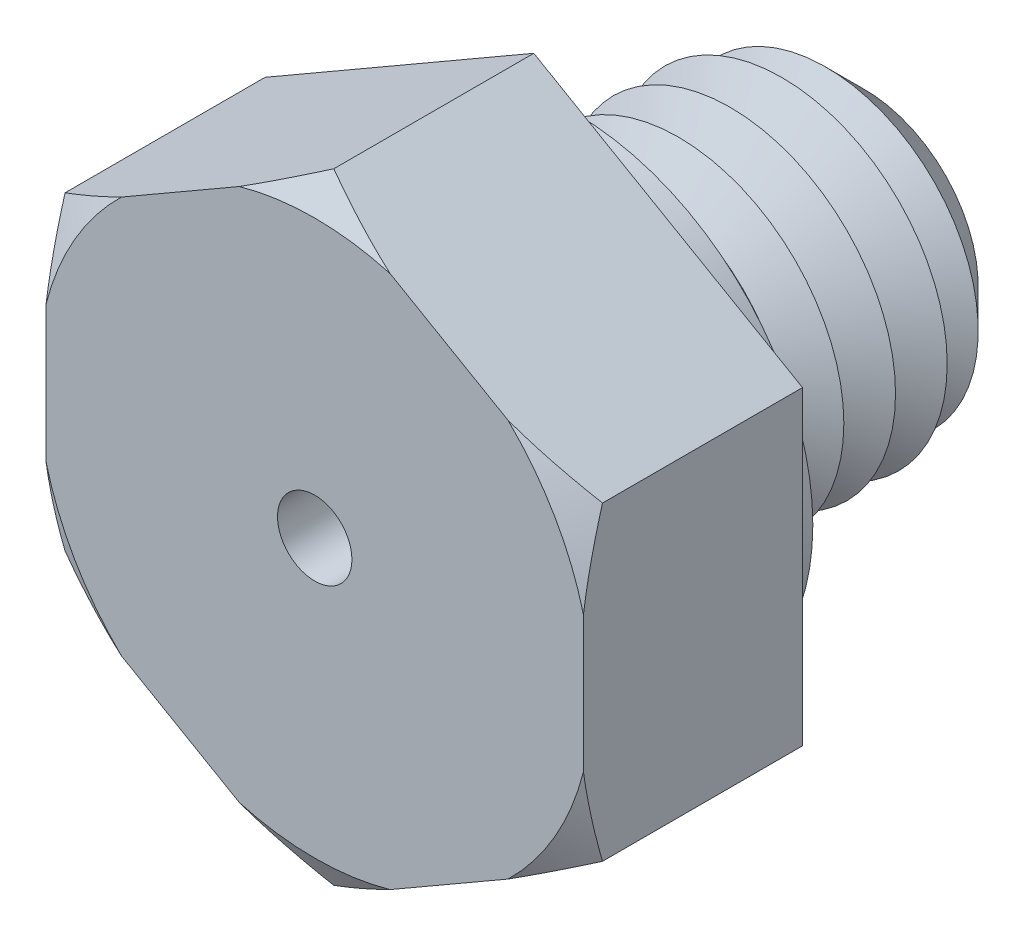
ISO-10303-21;
HEADER;
FILE_DESCRIPTION(('STEP AP214'),'2;1');
FILE_NAME('part.step','',(''),(''),'','','');
FILE_SCHEMA(('AUTOMOTIVE_DESIGN { 1 0 10303 214 1 1 1 1 }'));
ENDSEC;
DATA;
#1=APPLICATION_CONTEXT('core data for automotive mechanical design processes');
#2=APPLICATION_PROTOCOL_DEFINITION('international standard','automotive_design',2000,#1);
#3=PRODUCT_CONTEXT('',#1,'mechanical');
#4=PRODUCT('Part','Part','',(#3));
#5=PRODUCT_RELATED_PRODUCT_CATEGORY('part','',(#4));
#6=PRODUCT_DEFINITION_FORMATION('','',#4);
#7=PRODUCT_DEFINITION_CONTEXT('part definition',#1,'design');
#8=PRODUCT_DEFINITION('design','',#6,#7);
#9=PRODUCT_DEFINITION_SHAPE('','',#8);
#10=(LENGTH_UNIT() NAMED_UNIT(*) SI_UNIT(.MILLI.,.METRE.));
#11=(NAMED_UNIT(*) PLANE_ANGLE_UNIT() SI_UNIT($,.RADIAN.));
#12=(NAMED_UNIT(*) SI_UNIT($,.STERADIAN.) SOLID_ANGLE_UNIT());
#13=UNCERTAINTY_MEASURE_WITH_UNIT(LENGTH_MEASURE(1.E-05),#10,'distance_accuracy_value','');
#14=(GEOMETRIC_REPRESENTATION_CONTEXT(3) GLOBAL_UNCERTAINTY_ASSIGNED_CONTEXT((#13)) GLOBAL_UNIT_ASSIGNED_CONTEXT((#10,
#11,#12)) REPRESENTATION_CONTEXT('',''));
#15=CARTESIAN_POINT('',(0.,0.,0.));
#16=DIRECTION('',(0.,0.,1.));
#17=DIRECTION('',(1.,0.,0.));
#18=AXIS2_PLACEMENT_3D('',#15,#16,#17);
#19=CARTESIAN_POINT('',(6.5,3.75277674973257,5.3));
#20=DIRECTION('',(-0.5,-0.866025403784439,0.));
#21=DIRECTION('',(0.866025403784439,-0.5,0.));
#22=AXIS2_PLACEMENT_3D('',#19,#20,#21);
#23=PLANE('',#22);
#24=CARTESIAN_POINT('',(11.0120510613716,1.14774285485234,2.7792030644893));
#25=CARTESIAN_POINT('',(10.8078344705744,1.26564735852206,2.88939185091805));
#26=CARTESIAN_POINT('',(10.6031290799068,1.3838340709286,2.99839128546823));
#27=CARTESIAN_POINT('',(10.1925345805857,1.62089091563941,3.21345290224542));
#28=CARTESIAN_POINT('',(9.98664532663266,1.73976113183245,3.31951471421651));
#29=CARTESIAN_POINT('',(9.572864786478,1.97865743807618,3.52844955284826));
#30=CARTESIAN_POINT('',(9.36496919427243,2.09868601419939,3.63131124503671));
#31=CARTESIAN_POINT('',(8.94762012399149,2.33964261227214,3.8327211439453));
#32=CARTESIAN_POINT('',(8.73816669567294,2.46057060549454,3.93126948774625));
#33=CARTESIAN_POINT('',(8.31210847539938,2.70655543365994,4.12554493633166));
#34=CARTESIAN_POINT('',(8.0954571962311,2.83163910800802,4.22113674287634));
#35=CARTESIAN_POINT('',(7.65996896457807,3.08306835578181,4.40550790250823));
#36=CARTESIAN_POINT('',(7.44113190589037,3.20941399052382,4.49428692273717));
#37=CARTESIAN_POINT('',(7.00122142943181,3.46339642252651,4.66334180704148));
#38=CARTESIAN_POINT('',(6.78015039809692,3.59103184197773,4.74362587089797));
#39=CARTESIAN_POINT('',(6.33541282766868,3.84780119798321,4.89383693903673));
#40=CARTESIAN_POINT('',(6.11174662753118,3.97693493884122,4.96376527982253));
#41=CARTESIAN_POINT('',(5.57683009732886,4.28576914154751,5.11501441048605));
#42=CARTESIAN_POINT('',(5.26433342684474,4.46618917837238,5.19069976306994));
#43=CARTESIAN_POINT('',(4.79238520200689,4.73866861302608,5.28165255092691));
#44=CARTESIAN_POINT('',(4.63453792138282,4.82980178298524,5.30820735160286));
#45=CARTESIAN_POINT('',(4.31797843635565,5.01256748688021,5.35312391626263));
#46=CARTESIAN_POINT('',(4.15926635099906,5.10419995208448,5.37148678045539));
#47=CARTESIAN_POINT('',(3.84309853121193,5.28673952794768,5.3993333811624));
#48=CARTESIAN_POINT('',(3.68564943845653,5.37764280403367,5.4089171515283));
#49=CARTESIAN_POINT('',(3.37053331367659,5.55957518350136,5.41928234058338));
#50=CARTESIAN_POINT('',(3.21286628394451,5.6506042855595,5.42006385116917));
#51=CARTESIAN_POINT('',(2.89768626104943,5.83257355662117,5.41279964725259));
#52=CARTESIAN_POINT('',(2.74017326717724,5.92351372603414,5.40475397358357));
#53=CARTESIAN_POINT('',(2.42563627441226,6.1051117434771,5.38007889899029));
#54=CARTESIAN_POINT('',(2.26861235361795,6.1957695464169,5.36344819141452));
#55=CARTESIAN_POINT('',(1.89764555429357,6.40994732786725,5.31443879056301));
#56=CARTESIAN_POINT('',(1.68405122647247,6.53326607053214,5.27851525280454));
#57=CARTESIAN_POINT('',(1.258907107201,6.77872314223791,5.19313397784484));
#58=CARTESIAN_POINT('',(1.04735761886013,6.90086129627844,5.14367426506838));
#59=CARTESIAN_POINT('',(0.626329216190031,7.1439421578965,5.03308780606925));
#60=CARTESIAN_POINT('',(0.416852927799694,7.2648833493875,4.9719478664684));
#61=CARTESIAN_POINT('',(0.000251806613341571,7.50540811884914,4.83992704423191));
#62=CARTESIAN_POINT('',(-0.206873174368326,7.6249917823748,4.76904677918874));
#63=CARTESIAN_POINT('',(-0.621367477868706,7.86430018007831,4.61833709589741));
#64=CARTESIAN_POINT('',(-0.828710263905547,7.98400959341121,4.53841104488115));
#65=CARTESIAN_POINT('',(-1.24119921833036,8.22216020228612,4.37184860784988));
#66=CARTESIAN_POINT('',(-1.44634674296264,8.34060218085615,4.28521667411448));
#67=CARTESIAN_POINT('',(-1.8547720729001,8.57640665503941,4.10643213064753));
#68=CARTESIAN_POINT('',(-2.05805026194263,8.69376937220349,4.01428068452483));
#69=CARTESIAN_POINT('',(-2.46301289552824,8.92757465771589,3.82542322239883));
#70=CARTESIAN_POINT('',(-2.66469731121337,9.04401720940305,3.72871712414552));
#71=CARTESIAN_POINT('',(-3.00477721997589,9.24036243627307,3.56190249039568));
#72=CARTESIAN_POINT('',(-3.14353507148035,9.32047431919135,3.49277477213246));
#73=CARTESIAN_POINT('',(-3.42044427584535,9.48034792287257,3.35293264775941));
#74=CARTESIAN_POINT('',(-3.55859564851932,9.5601096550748,3.28221829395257));
#75=CARTESIAN_POINT('',(-3.83290330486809,9.71848125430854,3.14014092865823));
#76=CARTESIAN_POINT('',(-3.96906528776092,9.7970944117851,3.06879256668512));
#77=CARTESIAN_POINT('',(-4.24090766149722,9.9540426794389,2.92487520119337));
#78=CARTESIAN_POINT('',(-4.37658804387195,10.0323777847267,2.85230617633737));
#79=CARTESIAN_POINT('',(-4.5120510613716,10.1105873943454,2.7792030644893));
#80=B_SPLINE_CURVE_WITH_KNOTS('',3,(#24,#25,#26,#27,#28,#29,#30,#31,#32,#33,#34,#35,#36,#37,#38,
#39,#40,#41,#42,#43,#44,#45,#46,#47,#48,#49,#50,#51,#52,#53,#54,#55,#56,#57,#58,#59,#60,#61,#62,
#63,#64,#65,#66,#67,#68,#69,#70,#71,#72,#73,#74,#75,#76,#77,#78,#79),.UNSPECIFIED.,.F.,.F.,(4,2,
2,2,2,2,2,2,2,2,2,2,2,2,2,2,2,2,2,2,2,2,2,2,2,2,2,4),(0.,0.780858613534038,1.56181520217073,
2.34527979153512,3.12871946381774,3.93206444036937,4.73544864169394,5.53805016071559,
6.3405480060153,7.44542333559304,7.99784254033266,8.55018753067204,9.09615753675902,
9.64212184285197,10.1880836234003,10.7341285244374,11.4813961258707,12.2287728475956,
12.9769988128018,13.7251773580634,14.4822772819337,15.2388787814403,15.9953213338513,
16.7517775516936,17.2752695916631,17.7987444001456,18.3167123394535,18.8346893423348),.UNSPECIFIED.);
#81=CARTESIAN_POINT('',(6.5,3.75277674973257,4.83811978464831));
#82=VERTEX_POINT('',#81);
#83=CARTESIAN_POINT('',(4.67682717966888,4.80538606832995,5.3));
#84=VERTEX_POINT('',#83);
#85=EDGE_CURVE('E132',#82,#84,#80,.T.);
#86=ORIENTED_EDGE('',*,*,#85,.F.);
#87=DIRECTION('',(0.,0.,-1.));
#88=VECTOR('',#87,1.);
#89=CARTESIAN_POINT('',(6.5,3.75277674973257,5.3));
#90=LINE('',#89,#88);
#91=CARTESIAN_POINT('',(6.5,3.75277674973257,0.));
#92=VERTEX_POINT('',#91);
#93=EDGE_CURVE('E144',#82,#92,#90,.T.);
#94=ORIENTED_EDGE('',*,*,#93,.T.);
#95=DIRECTION('',(-0.866025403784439,0.5,0.));
#96=VECTOR('',#95,1.);
#97=CARTESIAN_POINT('',(6.5,3.75277674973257,0.));
#98=LINE('',#97,#96);
#99=CARTESIAN_POINT('',(0.,7.50555349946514,0.));
#100=VERTEX_POINT('',#99);
#101=EDGE_CURVE('E242',#92,#100,#98,.T.);
#102=ORIENTED_EDGE('',*,*,#101,.T.);
#103=DIRECTION('',(0.,0.,-1.));
#104=VECTOR('',#103,1.);
#105=CARTESIAN_POINT('',(0.,7.50555349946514,5.3));
#106=LINE('',#105,#104);
#107=CARTESIAN_POINT('',(0.,7.50555349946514,4.83811978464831));
#108=VERTEX_POINT('',#107);
#109=EDGE_CURVE('E178',#108,#100,#106,.T.);
#110=ORIENTED_EDGE('',*,*,#109,.F.);
#111=CARTESIAN_POINT('',(1.82317282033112,6.45294418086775,5.3));
#112=VERTEX_POINT('',#111);
#113=EDGE_CURVE('E151',#112,#108,#80,.T.);
#114=ORIENTED_EDGE('',*,*,#113,.F.);
#115=DIRECTION('',(-0.866025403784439,0.5,0.));
#116=VECTOR('',#115,1.);
#117=CARTESIAN_POINT('',(6.5,3.75277674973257,5.3));
#118=LINE('',#117,#116);
#119=EDGE_CURVE('E148',#84,#112,#118,.T.);
#120=ORIENTED_EDGE('',*,*,#119,.F.);
#121=EDGE_LOOP('',(#86,#94,#102,#110,#114,#120));
#122=FACE_BOUND('',#121,.T.);
#123=ADVANCED_FACE('F39',(#122),#23,.F.);
#124=CARTESIAN_POINT('',(0.,7.50555349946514,5.3));
#125=DIRECTION('',(0.5,-0.866025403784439,0.));
#126=DIRECTION('',(0.866025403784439,0.5,0.));
#127=AXIS2_PLACEMENT_3D('',#124,#125,#126);
#128=PLANE('',#127);
#129=CARTESIAN_POINT('',(4.51205106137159,10.1105873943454,2.77920306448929));
#130=CARTESIAN_POINT('',(4.30783447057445,9.99268289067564,2.88939185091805));
#131=CARTESIAN_POINT('',(4.1031290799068,9.87449617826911,2.99839128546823));
#132=CARTESIAN_POINT('',(3.69253458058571,9.63743933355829,3.21345290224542));
#133=CARTESIAN_POINT('',(3.48664532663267,9.51856911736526,3.31951471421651));
#134=CARTESIAN_POINT('',(3.072864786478,9.27967281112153,3.52844955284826));
#135=CARTESIAN_POINT('',(2.86496919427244,9.15964423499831,3.63131124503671));
#136=CARTESIAN_POINT('',(2.44762012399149,8.91868763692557,3.8327211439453));
#137=CARTESIAN_POINT('',(2.23816669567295,8.79775964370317,3.93126948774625));
#138=CARTESIAN_POINT('',(1.81210847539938,8.55177481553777,4.12554493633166));
#139=CARTESIAN_POINT('',(1.5954571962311,8.42669114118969,4.22113674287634));
#140=CARTESIAN_POINT('',(1.15996896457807,8.1752618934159,4.40550790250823));
#141=CARTESIAN_POINT('',(0.941131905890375,8.04891625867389,4.49428692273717));
#142=CARTESIAN_POINT('',(0.501221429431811,7.7949338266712,4.66334180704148));
#143=CARTESIAN_POINT('',(0.280150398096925,7.66729840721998,4.74362587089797));
#144=CARTESIAN_POINT('',(-0.164587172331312,7.41052905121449,4.89383693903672));
#145=CARTESIAN_POINT('',(-0.388253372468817,7.28139531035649,4.96376527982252));
#146=CARTESIAN_POINT('',(-0.923169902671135,6.9725611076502,5.11501441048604));
#147=CARTESIAN_POINT('',(-1.23566657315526,6.79214107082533,5.19069976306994));
#148=CARTESIAN_POINT('',(-1.7076147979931,6.51966163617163,5.28165255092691));
#149=CARTESIAN_POINT('',(-1.86546207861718,6.42852846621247,5.30820735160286));
#150=CARTESIAN_POINT('',(-2.18202156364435,6.2457627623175,5.35312391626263));
#151=CARTESIAN_POINT('',(-2.34073364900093,6.15413029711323,5.37148678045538));
#152=CARTESIAN_POINT('',(-2.65690146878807,5.97159072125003,5.3993333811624));
#153=CARTESIAN_POINT('',(-2.81435056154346,5.88068744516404,5.40891715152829));
#154=CARTESIAN_POINT('',(-3.12946668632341,5.69875506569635,5.41928234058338));
#155=CARTESIAN_POINT('',(-3.28713371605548,5.60772596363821,5.42006385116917));
#156=CARTESIAN_POINT('',(-3.60231373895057,5.42575669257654,5.41279964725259));
#157=CARTESIAN_POINT('',(-3.75982673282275,5.33481652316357,5.40475397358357));
#158=CARTESIAN_POINT('',(-4.07436372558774,5.15321850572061,5.38007889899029));
#159=CARTESIAN_POINT('',(-4.23138764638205,5.06256070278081,5.36344819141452));
#160=CARTESIAN_POINT('',(-4.60235444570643,4.84838292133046,5.31443879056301));
#161=CARTESIAN_POINT('',(-4.81594877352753,4.72506417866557,5.27851525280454));
#162=CARTESIAN_POINT('',(-5.24109289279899,4.4796071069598,5.19313397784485));
#163=CARTESIAN_POINT('',(-5.45264238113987,4.35746895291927,5.14367426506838));
#164=CARTESIAN_POINT('',(-5.87367078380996,4.11438809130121,5.03308780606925));
#165=CARTESIAN_POINT('',(-6.0831470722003,3.99344689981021,4.9719478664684));
#166=CARTESIAN_POINT('',(-6.49974819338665,3.75292213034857,4.83992704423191));
#167=CARTESIAN_POINT('',(-6.70687317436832,3.63333846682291,4.76904677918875));
#168=CARTESIAN_POINT('',(-7.1213674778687,3.3940300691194,4.61833709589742));
#169=CARTESIAN_POINT('',(-7.32871026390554,3.2743206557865,4.53841104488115));
#170=CARTESIAN_POINT('',(-7.74119921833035,3.03617004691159,4.37184860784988));
#171=CARTESIAN_POINT('',(-7.94634674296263,2.91772806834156,4.28521667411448));
#172=CARTESIAN_POINT('',(-8.35477207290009,2.6819235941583,4.10643213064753));
#173=CARTESIAN_POINT('',(-8.55805026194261,2.56456087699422,4.01428068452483));
#174=CARTESIAN_POINT('',(-8.96301289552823,2.33075559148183,3.82542322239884));
#175=CARTESIAN_POINT('',(-9.16469731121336,2.21431303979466,3.72871712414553));
#176=CARTESIAN_POINT('',(-9.50477721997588,2.01796781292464,3.56190249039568));
#177=CARTESIAN_POINT('',(-9.64353507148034,1.93785593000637,3.49277477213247));
#178=CARTESIAN_POINT('',(-9.92044427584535,1.77798232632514,3.35293264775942));
#179=CARTESIAN_POINT('',(-10.0585956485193,1.69822059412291,3.28221829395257));
#180=CARTESIAN_POINT('',(-10.3329033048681,1.53984899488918,3.14014092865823));
#181=CARTESIAN_POINT('',(-10.4690652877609,1.46123583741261,3.06879256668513));
#182=CARTESIAN_POINT('',(-10.7409076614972,1.30428756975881,2.92487520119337));
#183=CARTESIAN_POINT('',(-10.876588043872,1.225952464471,2.85230617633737));
#184=CARTESIAN_POINT('',(-11.0120510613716,1.14774285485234,2.7792030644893));
#185=B_SPLINE_CURVE_WITH_KNOTS('',3,(#129,#130,#131,#132,#133,#134,#135,#136,#137,#138,#139,
#140,#141,#142,#143,#144,#145,#146,#147,#148,#149,#150,#151,#152,#153,#154,#155,#156,#157,#158,
#159,#160,#161,#162,#163,#164,#165,#166,#167,#168,#169,#170,#171,#172,#173,#174,#175,#176,#177,
#178,#179,#180,#181,#182,#183,#184),.UNSPECIFIED.,.F.,.F.,(4,2,2,2,2,2,2,2,2,2,2,2,2,2,2,2,2,2,
2,2,2,2,2,2,2,2,2,4),(0.,0.780858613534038,1.56181520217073,2.34527979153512,3.12871946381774,
3.93206444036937,4.73544864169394,5.53805016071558,6.3405480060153,7.44542333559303,
7.99784254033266,8.55018753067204,9.09615753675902,9.64212184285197,10.1880836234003,
10.7341285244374,11.4813961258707,12.2287728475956,12.9769988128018,13.7251773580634,
14.4822772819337,15.2388787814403,15.9953213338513,16.7517775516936,17.2752695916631,
17.7987444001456,18.3167123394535,18.8346893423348),.UNSPECIFIED.);
#186=CARTESIAN_POINT('',(-1.82317282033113,6.45294418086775,5.3));
#187=VERTEX_POINT('',#186);
#188=EDGE_CURVE('E282',#108,#187,#185,.T.);
#189=ORIENTED_EDGE('',*,*,#188,.F.);
#190=ORIENTED_EDGE('',*,*,#109,.T.);
#191=DIRECTION('',(-0.866025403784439,-0.5,0.));
#192=VECTOR('',#191,1.);
#193=CARTESIAN_POINT('',(0.,7.50555349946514,0.));
#194=LINE('',#193,#192);
#195=CARTESIAN_POINT('',(-6.5,3.75277674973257,0.));
#196=VERTEX_POINT('',#195);
#197=EDGE_CURVE('E261',#100,#196,#194,.T.);
#198=ORIENTED_EDGE('',*,*,#197,.T.);
#199=DIRECTION('',(0.,0.,-1.));
#200=VECTOR('',#199,1.);
#201=CARTESIAN_POINT('',(-6.5,3.75277674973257,5.3));
#202=LINE('',#201,#200);
#203=CARTESIAN_POINT('',(-6.5,3.75277674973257,4.83811978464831));
#204=VERTEX_POINT('',#203);
#205=EDGE_CURVE('E175',#204,#196,#202,.T.);
#206=ORIENTED_EDGE('',*,*,#205,.F.);
#207=CARTESIAN_POINT('',(-4.67682717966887,4.80538606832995,5.3));
#208=VERTEX_POINT('',#207);
#209=EDGE_CURVE('E283',#208,#204,#185,.T.);
#210=ORIENTED_EDGE('',*,*,#209,.F.);
#211=DIRECTION('',(-0.866025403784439,-0.5,0.));
#212=VECTOR('',#211,1.);
#213=CARTESIAN_POINT('',(0.,7.50555349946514,5.3));
#214=LINE('',#213,#212);
#215=EDGE_CURVE('E245',#187,#208,#214,.T.);
#216=ORIENTED_EDGE('',*,*,#215,.F.);
#217=EDGE_LOOP('',(#189,#190,#198,#206,#210,#216));
#218=FACE_BOUND('',#217,.T.);
#219=ADVANCED_FACE('F301',(#218),#128,.F.);
#220=CARTESIAN_POINT('',(-6.5,3.75277674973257,5.3));
#221=DIRECTION('',(1.,0.,0.));
#222=DIRECTION('',(0.,0.,-1.));
#223=AXIS2_PLACEMENT_3D('',#220,#221,#222);
#224=PLANE('',#223);
#225=CARTESIAN_POINT('',(-6.5,8.26482781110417,3.10083044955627));
#226=CARTESIAN_POINT('',(-6.5,8.03000458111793,3.20736842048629));
#227=CARTESIAN_POINT('',(-6.5,7.79453887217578,3.31251727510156));
#228=CARTESIAN_POINT('',(-6.5,7.32204728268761,3.51936269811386));
#229=CARTESIAN_POINT('',(-6.5,7.08502112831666,3.62105864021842));
#230=CARTESIAN_POINT('',(-6.5,6.6082238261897,3.82070151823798));
#231=CARTESIAN_POINT('',(-6.5,6.36844534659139,3.91863101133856));
#232=CARTESIAN_POINT('',(-6.5,5.88686103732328,4.10935828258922));
#233=CARTESIAN_POINT('',(-6.5,5.64505530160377,4.20215629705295));
#234=CARTESIAN_POINT('',(-6.5,5.16020806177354,4.38107583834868));
#235=CARTESIAN_POINT('',(-6.5,4.91717698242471,4.46722547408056));
#236=CARTESIAN_POINT('',(-6.5,4.42851680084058,4.63190822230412));
#237=CARTESIAN_POINT('',(-6.5,4.18288757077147,4.71044095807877));
#238=CARTESIAN_POINT('',(-6.5,3.68915983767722,4.85808723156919));
#239=CARTESIAN_POINT('',(-6.5,3.44106517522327,4.9272135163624));
#240=CARTESIAN_POINT('',(-6.5,2.94198131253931,5.05420795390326));
#241=CARTESIAN_POINT('',(-6.5,2.69099223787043,5.11207659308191));
#242=CARTESIAN_POINT('',(-6.5,2.25769005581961,5.19995201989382));
#243=CARTESIAN_POINT('',(-6.5,2.07603591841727,5.23320954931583));
#244=CARTESIAN_POINT('',(-6.5,1.71151122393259,5.29207741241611));
#245=CARTESIAN_POINT('',(-6.5,1.52864087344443,5.31768901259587));
#246=CARTESIAN_POINT('',(-6.5,1.16195360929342,5.36059506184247));
#247=CARTESIAN_POINT('',(-6.5,0.978136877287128,5.37789105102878));
#248=CARTESIAN_POINT('',(-6.5,0.609880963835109,5.40367049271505));
#249=CARTESIAN_POINT('',(-6.5,0.425441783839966,5.41215396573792));
#250=CARTESIAN_POINT('',(-6.5,0.056461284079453,5.42004368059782));
#251=CARTESIAN_POINT('',(-6.5,-0.128079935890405,5.41945454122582));
#252=CARTESIAN_POINT('',(-6.5,-0.496907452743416,5.40922941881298));
#253=CARTESIAN_POINT('',(-6.5,-0.681193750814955,5.39959347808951));
#254=CARTESIAN_POINT('',(-6.5,-1.04910266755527,5.37156866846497));
#255=CARTESIAN_POINT('',(-6.5,-1.23272526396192,5.35317950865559));
#256=CARTESIAN_POINT('',(-6.5,-1.5989735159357,5.30817918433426));
#257=CARTESIAN_POINT('',(-6.5,-1.78159898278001,5.28156651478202));
#258=CARTESIAN_POINT('',(-6.5,-2.50904762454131,5.16009602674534));
#259=CARTESIAN_POINT('',(-6.5,-3.04897729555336,5.0350728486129));
#260=CARTESIAN_POINT('',(-6.5,-3.8489021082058,4.8122065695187));
#261=CARTESIAN_POINT('',(-6.5,-4.11422810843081,4.73189887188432));
#262=CARTESIAN_POINT('',(-6.5,-4.64182213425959,4.5617271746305));
#263=CARTESIAN_POINT('',(-6.5,-4.90409037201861,4.47186384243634));
#264=CARTESIAN_POINT('',(-6.5,-5.42881258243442,4.28339622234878));
#265=CARTESIAN_POINT('',(-6.5,-5.69123450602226,4.18470387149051));
#266=CARTESIAN_POINT('',(-6.5,-6.21363007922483,3.98100889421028));
#267=CARTESIAN_POINT('',(-6.5,-6.4736035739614,3.87600587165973));
#268=CARTESIAN_POINT('',(-6.5,-6.98982707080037,3.66159357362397));
#269=CARTESIAN_POINT('',(-6.5,-7.24609016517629,3.55221565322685));
#270=CARTESIAN_POINT('',(-6.5,-7.75676014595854,3.32937132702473));
#271=CARTESIAN_POINT('',(-6.5,-8.01116747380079,3.2159059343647));
#272=CARTESIAN_POINT('',(-6.5,-8.26482781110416,3.10083044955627));
#273=B_SPLINE_CURVE_WITH_KNOTS('',3,(#225,#226,#227,#228,#229,#230,#231,#232,#233,#234,#235,
#236,#237,#238,#239,#240,#241,#242,#243,#244,#245,#246,#247,#248,#249,#250,#251,#252,#253,#254,
#255,#256,#257,#258,#259,#260,#261,#262,#263,#264,#265,#266,#267,#268,#269,#270,#271,#272),
.UNSPECIFIED.,.F.,.F.,(4,2,2,2,2,2,2,2,2,2,2,2,2,2,2,2,2,2,2,2,2,2,2,4),(0.,0.773595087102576,
1.54732974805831,2.3242977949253,3.10123003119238,3.87467353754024,4.64815527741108,
5.42057817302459,6.19296768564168,6.74684672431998,7.30063396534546,7.85431860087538,
8.40800194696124,8.96140342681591,9.51480231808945,10.0682196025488,10.621738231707,
12.2804682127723,13.1120468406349,13.9435674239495,14.7845791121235,15.625643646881,
16.4614935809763,17.2971377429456),.UNSPECIFIED.);
#274=CARTESIAN_POINT('',(-6.5,1.64755811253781,5.3));
#275=VERTEX_POINT('',#274);
#276=EDGE_CURVE('E288',#204,#275,#273,.T.);
#277=ORIENTED_EDGE('',*,*,#276,.F.);
#278=ORIENTED_EDGE('',*,*,#205,.T.);
#279=DIRECTION('',(0.,-1.,0.));
#280=VECTOR('',#279,1.);
#281=CARTESIAN_POINT('',(-6.5,3.75277674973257,0.));
#282=LINE('',#281,#280);
#283=CARTESIAN_POINT('',(-6.5,-3.75277674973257,0.));
#284=VERTEX_POINT('',#283);
#285=EDGE_CURVE('E265',#196,#284,#282,.T.);
#286=ORIENTED_EDGE('',*,*,#285,.T.);
#287=DIRECTION('',(0.,0.,-1.));
#288=VECTOR('',#287,1.);
#289=CARTESIAN_POINT('',(-6.5,-3.75277674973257,5.3));
#290=LINE('',#289,#288);
#291=CARTESIAN_POINT('',(-6.5,-3.75277674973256,4.83811978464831));
#292=VERTEX_POINT('',#291);
#293=EDGE_CURVE('E173',#292,#284,#290,.T.);
#294=ORIENTED_EDGE('',*,*,#293,.F.);
#295=CARTESIAN_POINT('',(-6.5,-1.64755811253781,5.3));
#296=VERTEX_POINT('',#295);
#297=EDGE_CURVE('E295',#296,#292,#273,.T.);
#298=ORIENTED_EDGE('',*,*,#297,.F.);
#299=DIRECTION('',(0.,-1.,0.));
#300=VECTOR('',#299,1.);
#301=CARTESIAN_POINT('',(-6.5,3.75277674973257,5.3));
#302=LINE('',#301,#300);
#303=EDGE_CURVE('E249',#275,#296,#302,.T.);
#304=ORIENTED_EDGE('',*,*,#303,.F.);
#305=EDGE_LOOP('',(#277,#278,#286,#294,#298,#304));
#306=FACE_BOUND('',#305,.T.);
#307=ADVANCED_FACE('F342',(#306),#224,.F.);
#308=CARTESIAN_POINT('',(-6.5,-3.75277674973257,5.3));
#309=DIRECTION('',(0.5,0.866025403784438,0.));
#310=DIRECTION('',(-0.866025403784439,0.5,0.));
#311=AXIS2_PLACEMENT_3D('',#308,#309,#310);
#312=PLANE('',#311);
#313=CARTESIAN_POINT('',(-11.0120510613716,-1.14774285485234,2.77920306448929));
#314=CARTESIAN_POINT('',(-10.8078344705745,-1.26564735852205,2.88939185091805));
#315=CARTESIAN_POINT('',(-10.6031290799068,-1.38383407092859,2.99839128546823));
#316=CARTESIAN_POINT('',(-10.1925345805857,-1.6208909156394,3.21345290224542));
#317=CARTESIAN_POINT('',(-9.98664532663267,-1.73976113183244,3.31951471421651));
#318=CARTESIAN_POINT('',(-9.572864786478,-1.97865743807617,3.52844955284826));
#319=CARTESIAN_POINT('',(-9.36496919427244,-2.09868601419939,3.63131124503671));
#320=CARTESIAN_POINT('',(-8.94762012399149,-2.33964261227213,3.8327211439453));
#321=CARTESIAN_POINT('',(-8.73816669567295,-2.46057060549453,3.93126948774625));
#322=CARTESIAN_POINT('',(-8.31210847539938,-2.70655543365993,4.12554493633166));
#323=CARTESIAN_POINT('',(-8.0954571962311,-2.83163910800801,4.22113674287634));
#324=CARTESIAN_POINT('',(-7.65996896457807,-3.0830683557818,4.40550790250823));
#325=CARTESIAN_POINT('',(-7.44113190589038,-3.20941399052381,4.49428692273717));
#326=CARTESIAN_POINT('',(-7.00122142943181,-3.4633964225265,4.66334180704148));
#327=CARTESIAN_POINT('',(-6.78015039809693,-3.59103184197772,4.74362587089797));
#328=CARTESIAN_POINT('',(-6.33541282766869,-3.84780119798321,4.89383693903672));
#329=CARTESIAN_POINT('',(-6.11174662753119,-3.97693493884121,4.96376527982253));
#330=CARTESIAN_POINT('',(-5.57683009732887,-4.2857691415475,5.11501441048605));
#331=CARTESIAN_POINT('',(-5.26433342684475,-4.46618917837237,5.19069976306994));
#332=CARTESIAN_POINT('',(-4.7923852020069,-4.73866861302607,5.28165255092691));
#333=CARTESIAN_POINT('',(-4.63453792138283,-4.82980178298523,5.30820735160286));
#334=CARTESIAN_POINT('',(-4.31797843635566,-5.01256748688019,5.35312391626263));
#335=CARTESIAN_POINT('',(-4.15926635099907,-5.10419995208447,5.37148678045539));
#336=CARTESIAN_POINT('',(-3.84309853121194,-5.28673952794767,5.3993333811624));
#337=CARTESIAN_POINT('',(-3.68564943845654,-5.37764280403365,5.4089171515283));
#338=CARTESIAN_POINT('',(-3.3705333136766,-5.55957518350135,5.41928234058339));
#339=CARTESIAN_POINT('',(-3.21286628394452,-5.65060428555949,5.42006385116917));
#340=CARTESIAN_POINT('',(-2.89768626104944,-5.83257355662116,5.4127996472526));
#341=CARTESIAN_POINT('',(-2.74017326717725,-5.92351372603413,5.40475397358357));
#342=CARTESIAN_POINT('',(-2.42563627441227,-6.10511174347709,5.38007889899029));
#343=CARTESIAN_POINT('',(-2.26861235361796,-6.19576954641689,5.36344819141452));
#344=CARTESIAN_POINT('',(-1.89764555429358,-6.40994732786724,5.31443879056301));
#345=CARTESIAN_POINT('',(-1.68405122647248,-6.53326607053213,5.27851525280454));
#346=CARTESIAN_POINT('',(-1.25890710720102,-6.77872314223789,5.19313397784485));
#347=CARTESIAN_POINT('',(-1.04735761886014,-6.90086129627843,5.14367426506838));
#348=CARTESIAN_POINT('',(-0.626329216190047,-7.14394215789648,5.03308780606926));
#349=CARTESIAN_POINT('',(-0.41685292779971,-7.26488334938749,4.9719478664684));
#350=CARTESIAN_POINT('',(-0.000251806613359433,-7.50540811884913,4.83992704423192));
#351=CARTESIAN_POINT('',(0.206873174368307,-7.62499178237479,4.76904677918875));
#352=CARTESIAN_POINT('',(0.621367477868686,-7.8643001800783,4.61833709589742));
#353=CARTESIAN_POINT('',(0.828710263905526,-7.9840095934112,4.53841104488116));
#354=CARTESIAN_POINT('',(1.24119921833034,-8.22216020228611,4.37184860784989));
#355=CARTESIAN_POINT('',(1.44634674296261,-8.34060218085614,4.28521667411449));
#356=CARTESIAN_POINT('',(1.85477207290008,-8.5764066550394,4.10643213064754));
#357=CARTESIAN_POINT('',(2.0580502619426,-8.69376937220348,4.01428068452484));
#358=CARTESIAN_POINT('',(2.46301289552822,-8.92757465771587,3.82542322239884));
#359=CARTESIAN_POINT('',(2.66469731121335,-9.04401720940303,3.72871712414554));
#360=CARTESIAN_POINT('',(3.00477721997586,-9.24036243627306,3.56190249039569));
#361=CARTESIAN_POINT('',(3.14353507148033,-9.32047431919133,3.49277477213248));
#362=CARTESIAN_POINT('',(3.42044427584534,-9.48034792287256,3.35293264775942));
#363=CARTESIAN_POINT('',(3.55859564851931,-9.56010965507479,3.28221829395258));
#364=CARTESIAN_POINT('',(3.83290330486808,-9.71848125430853,3.14014092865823));
#365=CARTESIAN_POINT('',(3.96906528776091,-9.79709441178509,3.06879256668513));
#366=CARTESIAN_POINT('',(4.24090766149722,-9.9540426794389,2.92487520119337));
#367=CARTESIAN_POINT('',(4.37658804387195,-10.0323777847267,2.85230617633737));
#368=CARTESIAN_POINT('',(4.5120510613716,-10.1105873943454,2.7792030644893));
#369=B_SPLINE_CURVE_WITH_KNOTS('',3,(#313,#314,#315,#316,#317,#318,#319,#320,#321,#322,#323,
#324,#325,#326,#327,#328,#329,#330,#331,#332,#333,#334,#335,#336,#337,#338,#339,#340,#341,#342,
#343,#344,#345,#346,#347,#348,#349,#350,#351,#352,#353,#354,#355,#356,#357,#358,#359,#360,#361,
#362,#363,#364,#365,#366,#367,#368),.UNSPECIFIED.,.F.,.F.,(4,2,2,2,2,2,2,2,2,2,2,2,2,2,2,2,2,2,
2,2,2,2,2,2,2,2,2,4),(0.,0.780858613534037,1.56181520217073,2.34527979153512,3.12871946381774,
3.93206444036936,4.73544864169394,5.53805016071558,6.3405480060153,7.44542333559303,
7.99784254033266,8.55018753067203,9.09615753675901,9.64212184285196,10.1880836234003,
10.7341285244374,11.4813961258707,12.2287728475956,12.9769988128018,13.7251773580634,
14.4822772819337,15.2388787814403,15.9953213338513,16.7517775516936,17.2752695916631,
17.7987444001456,18.3167123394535,18.8346893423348),.UNSPECIFIED.);
#370=CARTESIAN_POINT('',(-4.67682717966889,-4.80538606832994,5.3));
#371=VERTEX_POINT('',#370);
#372=EDGE_CURVE('E337',#292,#371,#369,.T.);
#373=ORIENTED_EDGE('',*,*,#372,.F.);
#374=ORIENTED_EDGE('',*,*,#293,.T.);
#375=DIRECTION('',(0.866025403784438,-0.5,0.));
#376=VECTOR('',#375,1.);
#377=CARTESIAN_POINT('',(-6.5,-3.75277674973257,0.));
#378=LINE('',#377,#376);
#379=CARTESIAN_POINT('',(0.,-7.50555349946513,0.));
#380=VERTEX_POINT('',#379);
#381=EDGE_CURVE('E269',#284,#380,#378,.T.);
#382=ORIENTED_EDGE('',*,*,#381,.T.);
#383=DIRECTION('',(0.,0.,-1.));
#384=VECTOR('',#383,1.);
#385=CARTESIAN_POINT('',(0.,-7.50555349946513,5.3));
#386=LINE('',#385,#384);
#387=CARTESIAN_POINT('',(0.,-7.50555349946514,4.83811978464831));
#388=VERTEX_POINT('',#387);
#389=EDGE_CURVE('E163',#388,#380,#386,.T.);
#390=ORIENTED_EDGE('',*,*,#389,.F.);
#391=CARTESIAN_POINT('',(-1.82317282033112,-6.45294418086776,5.3));
#392=VERTEX_POINT('',#391);
#393=EDGE_CURVE('E331',#392,#388,#369,.T.);
#394=ORIENTED_EDGE('',*,*,#393,.F.);
#395=DIRECTION('',(0.866025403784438,-0.5,0.));
#396=VECTOR('',#395,1.);
#397=CARTESIAN_POINT('',(-6.5,-3.75277674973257,5.3));
#398=LINE('',#397,#396);
#399=EDGE_CURVE('E253',#371,#392,#398,.T.);
#400=ORIENTED_EDGE('',*,*,#399,.F.);
#401=EDGE_LOOP('',(#373,#374,#382,#390,#394,#400));
#402=FACE_BOUND('',#401,.T.);
#403=ADVANCED_FACE('F338',(#402),#312,.F.);
#404=CARTESIAN_POINT('',(0.,-7.50555349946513,5.3));
#405=DIRECTION('',(-0.5,0.866025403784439,0.));
#406=DIRECTION('',(-0.866025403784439,-0.5,0.));
#407=AXIS2_PLACEMENT_3D('',#404,#405,#406);
#408=PLANE('',#407);
#409=CARTESIAN_POINT('',(-4.5120510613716,-10.1105873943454,2.77920306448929));
#410=CARTESIAN_POINT('',(-4.30783447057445,-9.99268289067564,2.88939185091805));
#411=CARTESIAN_POINT('',(-4.1031290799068,-9.87449617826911,2.99839128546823));
#412=CARTESIAN_POINT('',(-3.69253458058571,-9.63743933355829,3.21345290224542));
#413=CARTESIAN_POINT('',(-3.48664532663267,-9.51856911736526,3.31951471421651));
#414=CARTESIAN_POINT('',(-3.072864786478,-9.27967281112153,3.52844955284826));
#415=CARTESIAN_POINT('',(-2.86496919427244,-9.15964423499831,3.63131124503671));
#416=CARTESIAN_POINT('',(-2.4476201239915,-8.91868763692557,3.8327211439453));
#417=CARTESIAN_POINT('',(-2.23816669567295,-8.79775964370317,3.93126948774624));
#418=CARTESIAN_POINT('',(-1.81210847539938,-8.55177481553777,4.12554493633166));
#419=CARTESIAN_POINT('',(-1.5954571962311,-8.42669114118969,4.22113674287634));
#420=CARTESIAN_POINT('',(-1.15996896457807,-8.1752618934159,4.40550790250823));
#421=CARTESIAN_POINT('',(-0.941131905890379,-8.04891625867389,4.49428692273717));
#422=CARTESIAN_POINT('',(-0.501221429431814,-7.7949338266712,4.66334180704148));
#423=CARTESIAN_POINT('',(-0.280150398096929,-7.66729840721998,4.74362587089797));
#424=CARTESIAN_POINT('',(0.164587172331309,-7.41052905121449,4.89383693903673));
#425=CARTESIAN_POINT('',(0.388253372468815,-7.28139531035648,4.96376527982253));
#426=CARTESIAN_POINT('',(0.923169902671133,-6.97256110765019,5.11501441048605));
#427=CARTESIAN_POINT('',(1.23566657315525,-6.79214107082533,5.19069976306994));
#428=CARTESIAN_POINT('',(1.7076147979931,-6.51966163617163,5.28165255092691));
#429=CARTESIAN_POINT('',(1.86546207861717,-6.42852846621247,5.30820735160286));
#430=CARTESIAN_POINT('',(2.18202156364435,-6.2457627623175,5.35312391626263));
#431=CARTESIAN_POINT('',(2.34073364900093,-6.15413029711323,5.37148678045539));
#432=CARTESIAN_POINT('',(2.65690146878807,-5.97159072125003,5.3993333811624));
#433=CARTESIAN_POINT('',(2.81435056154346,-5.88068744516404,5.4089171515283));
#434=CARTESIAN_POINT('',(3.1294666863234,-5.69875506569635,5.41928234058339));
#435=CARTESIAN_POINT('',(3.28713371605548,-5.60772596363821,5.42006385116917));
#436=CARTESIAN_POINT('',(3.60231373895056,-5.42575669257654,5.4127996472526));
#437=CARTESIAN_POINT('',(3.75982673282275,-5.33481652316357,5.40475397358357));
#438=CARTESIAN_POINT('',(4.07436372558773,-5.15321850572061,5.38007889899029));
#439=CARTESIAN_POINT('',(4.23138764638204,-5.06256070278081,5.36344819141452));
#440=CARTESIAN_POINT('',(4.60235444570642,-4.84838292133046,5.31443879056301));
#441=CARTESIAN_POINT('',(4.81594877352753,-4.72506417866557,5.27851525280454));
#442=CARTESIAN_POINT('',(5.24109289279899,-4.47960710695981,5.19313397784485));
#443=CARTESIAN_POINT('',(5.45264238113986,-4.35746895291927,5.14367426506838));
#444=CARTESIAN_POINT('',(5.87367078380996,-4.11438809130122,5.03308780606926));
#445=CARTESIAN_POINT('',(6.08314707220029,-3.99344689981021,4.9719478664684));
#446=CARTESIAN_POINT('',(6.49974819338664,-3.75292213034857,4.83992704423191));
#447=CARTESIAN_POINT('',(6.70687317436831,-3.63333846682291,4.76904677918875));
#448=CARTESIAN_POINT('',(7.12136747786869,-3.3940300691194,4.61833709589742));
#449=CARTESIAN_POINT('',(7.32871026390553,-3.2743206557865,4.53841104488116));
#450=CARTESIAN_POINT('',(7.74119921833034,-3.03617004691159,4.37184860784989));
#451=CARTESIAN_POINT('',(7.94634674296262,-2.91772806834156,4.28521667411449));
#452=CARTESIAN_POINT('',(8.35477207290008,-2.6819235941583,4.10643213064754));
#453=CARTESIAN_POINT('',(8.55805026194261,-2.56456087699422,4.01428068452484));
#454=CARTESIAN_POINT('',(8.96301289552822,-2.33075559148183,3.82542322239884));
#455=CARTESIAN_POINT('',(9.16469731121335,-2.21431303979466,3.72871712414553));
#456=CARTESIAN_POINT('',(9.50477721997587,-2.01796781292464,3.56190249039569));
#457=CARTESIAN_POINT('',(9.64353507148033,-1.93785593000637,3.49277477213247));
#458=CARTESIAN_POINT('',(9.92044427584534,-1.77798232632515,3.35293264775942));
#459=CARTESIAN_POINT('',(10.0585956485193,-1.69822059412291,3.28221829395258));
#460=CARTESIAN_POINT('',(10.3329033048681,-1.53984899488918,3.14014092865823));
#461=CARTESIAN_POINT('',(10.4690652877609,-1.46123583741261,3.06879256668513));
#462=CARTESIAN_POINT('',(10.7409076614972,-1.3042875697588,2.92487520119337));
#463=CARTESIAN_POINT('',(10.8765880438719,-1.225952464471,2.85230617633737));
#464=CARTESIAN_POINT('',(11.0120510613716,-1.14774285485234,2.7792030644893));
#465=B_SPLINE_CURVE_WITH_KNOTS('',3,(#409,#410,#411,#412,#413,#414,#415,#416,#417,#418,#419,
#420,#421,#422,#423,#424,#425,#426,#427,#428,#429,#430,#431,#432,#433,#434,#435,#436,#437,#438,
#439,#440,#441,#442,#443,#444,#445,#446,#447,#448,#449,#450,#451,#452,#453,#454,#455,#456,#457,
#458,#459,#460,#461,#462,#463,#464),.UNSPECIFIED.,.F.,.F.,(4,2,2,2,2,2,2,2,2,2,2,2,2,2,2,2,2,2,
2,2,2,2,2,2,2,2,2,4),(0.,0.780858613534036,1.56181520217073,2.34527979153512,3.12871946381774,
3.93206444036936,4.73544864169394,5.53805016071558,6.3405480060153,7.44542333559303,
7.99784254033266,8.55018753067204,9.09615753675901,9.64212184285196,10.1880836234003,
10.7341285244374,11.4813961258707,12.2287728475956,12.9769988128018,13.7251773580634,
14.4822772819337,15.2388787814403,15.9953213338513,16.7517775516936,17.2752695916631,
17.7987444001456,18.3167123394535,18.8346893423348),.UNSPECIFIED.);
#466=CARTESIAN_POINT('',(1.82317282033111,-6.45294418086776,5.3));
#467=VERTEX_POINT('',#466);
#468=EDGE_CURVE('E64',#388,#467,#465,.T.);
#469=ORIENTED_EDGE('',*,*,#468,.F.);
#470=ORIENTED_EDGE('',*,*,#389,.T.);
#471=DIRECTION('',(0.866025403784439,0.5,0.));
#472=VECTOR('',#471,1.);
#473=CARTESIAN_POINT('',(0.,-7.50555349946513,0.));
#474=LINE('',#473,#472);
#475=CARTESIAN_POINT('',(6.5,-3.75277674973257,0.));
#476=VERTEX_POINT('',#475);
#477=EDGE_CURVE('E272',#380,#476,#474,.T.);
#478=ORIENTED_EDGE('',*,*,#477,.T.);
#479=DIRECTION('',(0.,0.,-1.));
#480=VECTOR('',#479,1.);
#481=CARTESIAN_POINT('',(6.5,-3.75277674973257,5.3));
#482=LINE('',#481,#480);
#483=CARTESIAN_POINT('',(6.5,-3.75277674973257,4.83811978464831));
#484=VERTEX_POINT('',#483);
#485=EDGE_CURVE('E157',#484,#476,#482,.T.);
#486=ORIENTED_EDGE('',*,*,#485,.F.);
#487=CARTESIAN_POINT('',(4.67682717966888,-4.80538606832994,5.3));
#488=VERTEX_POINT('',#487);
#489=EDGE_CURVE('E326',#488,#484,#465,.T.);
#490=ORIENTED_EDGE('',*,*,#489,.F.);
#491=DIRECTION('',(0.866025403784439,0.5,0.));
#492=VECTOR('',#491,1.);
#493=CARTESIAN_POINT('',(0.,-7.50555349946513,5.3));
#494=LINE('',#493,#492);
#495=EDGE_CURVE('E166',#467,#488,#494,.T.);
#496=ORIENTED_EDGE('',*,*,#495,.F.);
#497=EDGE_LOOP('',(#469,#470,#478,#486,#490,#496));
#498=FACE_BOUND('',#497,.T.);
#499=ADVANCED_FACE('F341',(#498),#408,.F.);
#500=CARTESIAN_POINT('',(6.5,-3.75277674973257,5.3));
#501=DIRECTION('',(-1.,0.,0.));
#502=DIRECTION('',(0.,-1.,0.));
#503=AXIS2_PLACEMENT_3D('',#500,#501,#502);
#504=PLANE('',#503);
#505=CARTESIAN_POINT('',(6.5,-8.26482781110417,3.10083044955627));
#506=CARTESIAN_POINT('',(6.5,-8.03000458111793,3.20736842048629));
#507=CARTESIAN_POINT('',(6.5,-7.79453887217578,3.31251727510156));
#508=CARTESIAN_POINT('',(6.5,-7.32204728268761,3.51936269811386));
#509=CARTESIAN_POINT('',(6.5,-7.08502112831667,3.62105864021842));
#510=CARTESIAN_POINT('',(6.5,-6.6082238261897,3.82070151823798));
#511=CARTESIAN_POINT('',(6.5,-6.3684453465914,3.91863101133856));
#512=CARTESIAN_POINT('',(6.5,-5.88686103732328,4.10935828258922));
#513=CARTESIAN_POINT('',(6.5,-5.64505530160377,4.20215629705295));
#514=CARTESIAN_POINT('',(6.5,-5.16020806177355,4.38107583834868));
#515=CARTESIAN_POINT('',(6.5,-4.91717698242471,4.46722547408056));
#516=CARTESIAN_POINT('',(6.5,-4.42851680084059,4.63190822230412));
#517=CARTESIAN_POINT('',(6.5,-4.18288757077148,4.71044095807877));
#518=CARTESIAN_POINT('',(6.5,-3.68915983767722,4.85808723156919));
#519=CARTESIAN_POINT('',(6.5,-3.44106517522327,4.9272135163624));
#520=CARTESIAN_POINT('',(6.5,-2.94198131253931,5.05420795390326));
#521=CARTESIAN_POINT('',(6.5,-2.69099223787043,5.11207659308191));
#522=CARTESIAN_POINT('',(6.5,-2.25769005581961,5.19995201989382));
#523=CARTESIAN_POINT('',(6.5,-2.07603591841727,5.23320954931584));
#524=CARTESIAN_POINT('',(6.5,-1.71151122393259,5.29207741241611));
#525=CARTESIAN_POINT('',(6.5,-1.52864087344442,5.31768901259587));
#526=CARTESIAN_POINT('',(6.5,-1.16195360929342,5.36059506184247));
#527=CARTESIAN_POINT('',(6.5,-0.978136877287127,5.37789105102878));
#528=CARTESIAN_POINT('',(6.5,-0.609880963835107,5.40367049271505));
#529=CARTESIAN_POINT('',(6.5,-0.425441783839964,5.41215396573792));
#530=CARTESIAN_POINT('',(6.5,-0.0564612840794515,5.42004368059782));
#531=CARTESIAN_POINT('',(6.5,0.128079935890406,5.41945454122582));
#532=CARTESIAN_POINT('',(6.5,0.496907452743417,5.40922941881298));
#533=CARTESIAN_POINT('',(6.5,0.681193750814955,5.39959347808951));
#534=CARTESIAN_POINT('',(6.5,1.04910266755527,5.37156866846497));
#535=CARTESIAN_POINT('',(6.5,1.23272526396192,5.35317950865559));
#536=CARTESIAN_POINT('',(6.5,1.5989735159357,5.30817918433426));
#537=CARTESIAN_POINT('',(6.5,1.78159898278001,5.28156651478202));
#538=CARTESIAN_POINT('',(6.5,2.50904762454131,5.16009602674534));
#539=CARTESIAN_POINT('',(6.5,3.04897729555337,5.0350728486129));
#540=CARTESIAN_POINT('',(6.5,3.8489021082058,4.8122065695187));
#541=CARTESIAN_POINT('',(6.5,4.11422810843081,4.73189887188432));
#542=CARTESIAN_POINT('',(6.5,4.64182213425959,4.5617271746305));
#543=CARTESIAN_POINT('',(6.5,4.90409037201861,4.47186384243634));
#544=CARTESIAN_POINT('',(6.5,5.42881258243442,4.28339622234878));
#545=CARTESIAN_POINT('',(6.5,5.69123450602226,4.18470387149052));
#546=CARTESIAN_POINT('',(6.5,6.21363007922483,3.98100889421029));
#547=CARTESIAN_POINT('',(6.5,6.4736035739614,3.87600587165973));
#548=CARTESIAN_POINT('',(6.5,6.98982707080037,3.66159357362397));
#549=CARTESIAN_POINT('',(6.5,7.24609016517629,3.55221565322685));
#550=CARTESIAN_POINT('',(6.5,7.75676014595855,3.32937132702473));
#551=CARTESIAN_POINT('',(6.5,8.0111674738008,3.2159059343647));
#552=CARTESIAN_POINT('',(6.5,8.26482781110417,3.10083044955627));
#553=B_SPLINE_CURVE_WITH_KNOTS('',3,(#505,#506,#507,#508,#509,#510,#511,#512,#513,#514,#515,
#516,#517,#518,#519,#520,#521,#522,#523,#524,#525,#526,#527,#528,#529,#530,#531,#532,#533,#534,
#535,#536,#537,#538,#539,#540,#541,#542,#543,#544,#545,#546,#547,#548,#549,#550,#551,#552),
.UNSPECIFIED.,.F.,.F.,(4,2,2,2,2,2,2,2,2,2,2,2,2,2,2,2,2,2,2,2,2,2,2,4),(0.,0.773595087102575,
1.54732974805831,2.3242977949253,3.10123003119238,3.87467353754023,4.64815527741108,
5.42057817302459,6.19296768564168,6.74684672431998,7.30063396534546,7.85431860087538,
8.40800194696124,8.96140342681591,9.51480231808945,10.0682196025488,10.621738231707,
12.2804682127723,13.1120468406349,13.9435674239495,14.7845791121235,15.625643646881,
16.4614935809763,17.2971377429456),.UNSPECIFIED.);
#554=CARTESIAN_POINT('',(6.5,-1.64755811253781,5.3));
#555=VERTEX_POINT('',#554);
#556=EDGE_CURVE('E56',#484,#555,#553,.T.);
#557=ORIENTED_EDGE('',*,*,#556,.F.);
#558=ORIENTED_EDGE('',*,*,#485,.T.);
#559=DIRECTION('',(0.,1.,0.));
#560=VECTOR('',#559,1.);
#561=CARTESIAN_POINT('',(6.5,-3.75277674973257,0.));
#562=LINE('',#561,#560);
#563=EDGE_CURVE('E154',#476,#92,#562,.T.);
#564=ORIENTED_EDGE('',*,*,#563,.T.);
#565=ORIENTED_EDGE('',*,*,#93,.F.);
#566=CARTESIAN_POINT('',(6.5,1.64755811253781,5.3));
#567=VERTEX_POINT('',#566);
#568=EDGE_CURVE('E129',#567,#82,#553,.T.);
#569=ORIENTED_EDGE('',*,*,#568,.F.);
#570=DIRECTION('',(0.,1.,0.));
#571=VECTOR('',#570,1.);
#572=CARTESIAN_POINT('',(6.5,-3.75277674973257,5.3));
#573=LINE('',#572,#571);
#574=EDGE_CURVE('E158',#555,#567,#573,.T.);
#575=ORIENTED_EDGE('',*,*,#574,.F.);
#576=EDGE_LOOP('',(#557,#558,#564,#565,#569,#575));
#577=FACE_BOUND('',#576,.T.);
#578=ADVANCED_FACE('F152',(#577),#504,.F.);
#579=CARTESIAN_POINT('',(0.,0.,5.3));
#580=DIRECTION('',(0.,0.,1.));
#581=DIRECTION('',(1.,0.,0.));
#582=AXIS2_PLACEMENT_3D('',#579,#580,#581);
#583=PLANE('',#582);
#584=CARTESIAN_POINT('',(0.,0.,5.3));
#585=DIRECTION('',(0.,0.,1.));
#586=DIRECTION('',(1.,0.,0.));
#587=AXIS2_PLACEMENT_3D('',#584,#585,#586);
#588=CIRCLE('',#587,0.9);
#589=CARTESIAN_POINT('',(0.9,0.,5.3));
#590=VERTEX_POINT('',#589);
#591=EDGE_CURVE('E631',#590,#590,#588,.T.);
#592=ORIENTED_EDGE('',*,*,#591,.F.);
#593=EDGE_LOOP('',(#592));
#594=FACE_BOUND('',#593,.T.);
#595=ORIENTED_EDGE('',*,*,#574,.T.);
#596=CARTESIAN_POINT('',(0.,0.,5.3));
#597=DIRECTION('',(0.,0.,1.));
#598=DIRECTION('',(1.,0.,0.));
#599=AXIS2_PLACEMENT_3D('',#596,#597,#598);
#600=CIRCLE('',#599,6.70555349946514);
#601=EDGE_CURVE('E134',#567,#84,#600,.T.);
#602=ORIENTED_EDGE('',*,*,#601,.T.);
#603=ORIENTED_EDGE('',*,*,#119,.T.);
#604=CARTESIAN_POINT('',(0.,0.,5.3));
#605=DIRECTION('',(0.,0.,1.));
#606=DIRECTION('',(1.,0.,0.));
#607=AXIS2_PLACEMENT_3D('',#604,#605,#606);
#608=CIRCLE('',#607,6.70555349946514);
#609=EDGE_CURVE('E11',#112,#187,#608,.T.);
#610=ORIENTED_EDGE('',*,*,#609,.T.);
#611=ORIENTED_EDGE('',*,*,#215,.T.);
#612=EDGE_CURVE('E49',#208,#275,#608,.T.);
#613=ORIENTED_EDGE('',*,*,#612,.T.);
#614=ORIENTED_EDGE('',*,*,#303,.T.);
#615=EDGE_CURVE('E280',#296,#371,#608,.T.);
#616=ORIENTED_EDGE('',*,*,#615,.T.);
#617=ORIENTED_EDGE('',*,*,#399,.T.);
#618=EDGE_CURVE('E642',#392,#467,#608,.T.);
#619=ORIENTED_EDGE('',*,*,#618,.T.);
#620=ORIENTED_EDGE('',*,*,#495,.T.);
#621=EDGE_CURVE('E43',#488,#555,#608,.T.);
#622=ORIENTED_EDGE('',*,*,#621,.T.);
#623=EDGE_LOOP('',(#595,#602,#603,#610,#611,#613,#614,#616,#617,#619,#620,#622));
#624=FACE_BOUND('',#623,.T.);
#625=ADVANCED_FACE('F381',(#594,#624),#583,.T.);
#626=CARTESIAN_POINT('',(0.,0.,0.));
#627=DIRECTION('',(0.,0.,1.));
#628=DIRECTION('',(1.,0.,0.));
#629=AXIS2_PLACEMENT_3D('',#626,#627,#628);
#630=PLANE('',#629);
#631=CARTESIAN_POINT('',(0.,0.,0.));
#632=DIRECTION('',(0.,0.,1.));
#633=DIRECTION('',(1.,0.,0.));
#634=AXIS2_PLACEMENT_3D('',#631,#632,#633);
#635=CIRCLE('',#634,5.75);
#636=CARTESIAN_POINT('',(5.75,0.,0.));
#637=VERTEX_POINT('',#636);
#638=EDGE_CURVE('E181',#637,#637,#635,.F.);
#639=ORIENTED_EDGE('',*,*,#638,.F.);
#640=EDGE_LOOP('',(#639));
#641=FACE_BOUND('',#640,.T.);
#642=ORIENTED_EDGE('',*,*,#101,.F.);
#643=ORIENTED_EDGE('',*,*,#563,.F.);
#644=ORIENTED_EDGE('',*,*,#477,.F.);
#645=ORIENTED_EDGE('',*,*,#381,.F.);
#646=ORIENTED_EDGE('',*,*,#285,.F.);
#647=ORIENTED_EDGE('',*,*,#197,.F.);
#648=EDGE_LOOP('',(#642,#643,#644,#645,#646,#647));
#649=FACE_BOUND('',#648,.T.);
#650=ADVANCED_FACE('F389',(#641,#649),#630,.F.);
#651=CARTESIAN_POINT('',(0.,0.,-1.));
#652=DIRECTION('',(0.,0.,1.));
#653=DIRECTION('',(1.,0.,0.));
#654=AXIS2_PLACEMENT_3D('',#651,#652,#653);
#655=CYLINDRICAL_SURFACE('',#654,5.75);
#656=CARTESIAN_POINT('',(0.,0.,-1.));
#657=DIRECTION('',(0.,0.,-1.));
#658=DIRECTION('',(-1.,0.,0.));
#659=AXIS2_PLACEMENT_3D('',#656,#657,#658);
#660=CIRCLE('',#659,5.75);
#661=CARTESIAN_POINT('',(-5.75,0.,-1.));
#662=VERTEX_POINT('',#661);
#663=EDGE_CURVE('E239',#662,#662,#660,.T.);
#664=ORIENTED_EDGE('',*,*,#663,.F.);
#665=EDGE_LOOP('',(#664));
#666=FACE_BOUND('',#665,.T.);
#667=ORIENTED_EDGE('',*,*,#638,.T.);
#668=EDGE_LOOP('',(#667));
#669=FACE_BOUND('',#668,.T.);
#670=ADVANCED_FACE('F400',(#666,#669),#655,.T.);
#671=CARTESIAN_POINT('',(0.,0.,-1.));
#672=DIRECTION('',(0.,0.,-1.));
#673=DIRECTION('',(-1.,0.,0.));
#674=AXIS2_PLACEMENT_3D('',#671,#672,#673);
#675=PLANE('',#674);
#676=CARTESIAN_POINT('',(0.,0.,-1.));
#677=DIRECTION('',(0.,0.,1.));
#678=DIRECTION('',(1.,0.,0.));
#679=AXIS2_PLACEMENT_3D('',#676,#677,#678);
#680=CIRCLE('',#679,4.);
#681=CARTESIAN_POINT('',(4.,0.,-1.));
#682=VERTEX_POINT('',#681);
#683=EDGE_CURVE('E235',#682,#682,#680,.T.);
#684=ORIENTED_EDGE('',*,*,#683,.T.);
#685=EDGE_LOOP('',(#684));
#686=FACE_BOUND('',#685,.T.);
#687=ORIENTED_EDGE('',*,*,#663,.T.);
#688=EDGE_LOOP('',(#687));
#689=FACE_BOUND('',#688,.T.);
#690=ADVANCED_FACE('F409',(#686,#689),#675,.T.);
#691=CARTESIAN_POINT('',(0.,0.,-1.));
#692=DIRECTION('',(0.,0.,1.));
#693=DIRECTION('',(1.,0.,0.));
#694=AXIS2_PLACEMENT_3D('',#691,#692,#693);
#695=CONICAL_SURFACE('',#694,4.,1.0471975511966);
#696=CARTESIAN_POINT('',(0.,0.,-1.625));
#697=DIRECTION('',(0.,0.,1.));
#698=DIRECTION('',(1.,0.,0.));
#699=AXIS2_PLACEMENT_3D('',#696,#697,#698);
#700=CIRCLE('',#699,2.91746824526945);
#701=CARTESIAN_POINT('',(2.91746824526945,0.,-1.625));
#702=VERTEX_POINT('',#701);
#703=EDGE_CURVE('E231',#702,#702,#700,.T.);
#704=ORIENTED_EDGE('',*,*,#703,.T.);
#705=EDGE_LOOP('',(#704));
#706=FACE_BOUND('',#705,.T.);
#707=ORIENTED_EDGE('',*,*,#683,.F.);
#708=EDGE_LOOP('',(#707));
#709=FACE_BOUND('',#708,.T.);
#710=ADVANCED_FACE('F418',(#706,#709),#695,.T.);
#711=CARTESIAN_POINT('',(0.,0.,-1.625));
#712=DIRECTION('',(0.,0.,-1.));
#713=DIRECTION('',(-1.,0.,0.));
#714=AXIS2_PLACEMENT_3D('',#711,#712,#713);
#715=CONICAL_SURFACE('',#714,2.91746824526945,1.0471975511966);
#716=CARTESIAN_POINT('',(0.,0.,-2.25));
#717=DIRECTION('',(0.,0.,1.));
#718=DIRECTION('',(1.,0.,0.));
#719=AXIS2_PLACEMENT_3D('',#716,#717,#718);
#720=CIRCLE('',#719,4.);
#721=CARTESIAN_POINT('',(4.,0.,-2.25));
#722=VERTEX_POINT('',#721);
#723=EDGE_CURVE('E227',#722,#722,#720,.T.);
#724=ORIENTED_EDGE('',*,*,#723,.T.);
#725=EDGE_LOOP('',(#724));
#726=FACE_BOUND('',#725,.T.);
#727=ORIENTED_EDGE('',*,*,#703,.F.);
#728=EDGE_LOOP('',(#727));
#729=FACE_BOUND('',#728,.T.);
#730=ADVANCED_FACE('F427',(#726,#729),#715,.T.);
#731=CARTESIAN_POINT('',(0.,0.,-2.25));
#732=DIRECTION('',(0.,0.,1.));
#733=DIRECTION('',(1.,0.,0.));
#734=AXIS2_PLACEMENT_3D('',#731,#732,#733);
#735=CONICAL_SURFACE('',#734,4.,1.0471975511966);
#736=CARTESIAN_POINT('',(0.,0.,-2.875));
#737=DIRECTION('',(0.,0.,1.));
#738=DIRECTION('',(1.,0.,0.));
#739=AXIS2_PLACEMENT_3D('',#736,#737,#738);
#740=CIRCLE('',#739,2.91746824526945);
#741=CARTESIAN_POINT('',(2.91746824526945,0.,-2.875));
#742=VERTEX_POINT('',#741);
#743=EDGE_CURVE('E223',#742,#742,#740,.T.);
#744=ORIENTED_EDGE('',*,*,#743,.T.);
#745=EDGE_LOOP('',(#744));
#746=FACE_BOUND('',#745,.T.);
#747=ORIENTED_EDGE('',*,*,#723,.F.);
#748=EDGE_LOOP('',(#747));
#749=FACE_BOUND('',#748,.T.);
#750=ADVANCED_FACE('F436',(#746,#749),#735,.T.);
#751=CARTESIAN_POINT('',(0.,0.,-2.875));
#752=DIRECTION('',(0.,0.,-1.));
#753=DIRECTION('',(-1.,0.,0.));
#754=AXIS2_PLACEMENT_3D('',#751,#752,#753);
#755=CONICAL_SURFACE('',#754,2.91746824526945,1.0471975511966);
#756=CARTESIAN_POINT('',(0.,0.,-3.5));
#757=DIRECTION('',(0.,0.,1.));
#758=DIRECTION('',(1.,0.,0.));
#759=AXIS2_PLACEMENT_3D('',#756,#757,#758);
#760=CIRCLE('',#759,4.);
#761=CARTESIAN_POINT('',(4.,0.,-3.5));
#762=VERTEX_POINT('',#761);
#763=EDGE_CURVE('E219',#762,#762,#760,.T.);
#764=ORIENTED_EDGE('',*,*,#763,.T.);
#765=EDGE_LOOP('',(#764));
#766=FACE_BOUND('',#765,.T.);
#767=ORIENTED_EDGE('',*,*,#743,.F.);
#768=EDGE_LOOP('',(#767));
#769=FACE_BOUND('',#768,.T.);
#770=ADVANCED_FACE('F445',(#766,#769),#755,.T.);
#771=CARTESIAN_POINT('',(0.,0.,-3.5));
#772=DIRECTION('',(0.,0.,1.));
#773=DIRECTION('',(1.,0.,0.));
#774=AXIS2_PLACEMENT_3D('',#771,#772,#773);
#775=CONICAL_SURFACE('',#774,4.,1.0471975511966);
#776=CARTESIAN_POINT('',(0.,0.,-4.125));
#777=DIRECTION('',(0.,0.,1.));
#778=DIRECTION('',(1.,0.,0.));
#779=AXIS2_PLACEMENT_3D('',#776,#777,#778);
#780=CIRCLE('',#779,2.91746824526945);
#781=CARTESIAN_POINT('',(2.91746824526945,0.,-4.125));
#782=VERTEX_POINT('',#781);
#783=EDGE_CURVE('E215',#782,#782,#780,.T.);
#784=ORIENTED_EDGE('',*,*,#783,.T.);
#785=EDGE_LOOP('',(#784));
#786=FACE_BOUND('',#785,.T.);
#787=ORIENTED_EDGE('',*,*,#763,.F.);
#788=EDGE_LOOP('',(#787));
#789=FACE_BOUND('',#788,.T.);
#790=ADVANCED_FACE('F454',(#786,#789),#775,.T.);
#791=CARTESIAN_POINT('',(0.,0.,-4.125));
#792=DIRECTION('',(0.,0.,-1.));
#793=DIRECTION('',(-1.,0.,0.));
#794=AXIS2_PLACEMENT_3D('',#791,#792,#793);
#795=CONICAL_SURFACE('',#794,2.91746824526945,1.0471975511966);
#796=CARTESIAN_POINT('',(0.,0.,-4.75));
#797=DIRECTION('',(0.,0.,1.));
#798=DIRECTION('',(1.,0.,0.));
#799=AXIS2_PLACEMENT_3D('',#796,#797,#798);
#800=CIRCLE('',#799,4.);
#801=CARTESIAN_POINT('',(4.,0.,-4.75));
#802=VERTEX_POINT('',#801);
#803=EDGE_CURVE('E198',#802,#802,#800,.T.);
#804=ORIENTED_EDGE('',*,*,#803,.T.);
#805=EDGE_LOOP('',(#804));
#806=FACE_BOUND('',#805,.T.);
#807=ORIENTED_EDGE('',*,*,#783,.F.);
#808=EDGE_LOOP('',(#807));
#809=FACE_BOUND('',#808,.T.);
#810=ADVANCED_FACE('F463',(#806,#809),#795,.T.);
#811=CARTESIAN_POINT('',(0.,0.,-4.75));
#812=DIRECTION('',(0.,0.,1.));
#813=DIRECTION('',(1.,0.,0.));
#814=AXIS2_PLACEMENT_3D('',#811,#812,#813);
#815=CONICAL_SURFACE('',#814,4.,1.0471975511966);
#816=CARTESIAN_POINT('',(0.,0.,-5.375));
#817=DIRECTION('',(0.,0.,1.));
#818=DIRECTION('',(1.,0.,0.));
#819=AXIS2_PLACEMENT_3D('',#816,#817,#818);
#820=CIRCLE('',#819,2.91746824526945);
#821=CARTESIAN_POINT('',(2.91746824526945,0.,-5.375));
#822=VERTEX_POINT('',#821);
#823=EDGE_CURVE('E191',#822,#822,#820,.T.);
#824=ORIENTED_EDGE('',*,*,#823,.T.);
#825=EDGE_LOOP('',(#824));
#826=FACE_BOUND('',#825,.T.);
#827=ORIENTED_EDGE('',*,*,#803,.F.);
#828=EDGE_LOOP('',(#827));
#829=FACE_BOUND('',#828,.T.);
#830=ADVANCED_FACE('F472',(#826,#829),#815,.T.);
#831=CARTESIAN_POINT('',(0.,0.,-5.375));
#832=DIRECTION('',(0.,0.,-1.));
#833=DIRECTION('',(-1.,0.,0.));
#834=AXIS2_PLACEMENT_3D('',#831,#832,#833);
#835=CONICAL_SURFACE('',#834,2.91746824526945,1.0471975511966);
#836=CARTESIAN_POINT('',(0.,0.,-6.));
#837=DIRECTION('',(0.,0.,1.));
#838=DIRECTION('',(1.,0.,0.));
#839=AXIS2_PLACEMENT_3D('',#836,#837,#838);
#840=CIRCLE('',#839,4.);
#841=CARTESIAN_POINT('',(4.,0.,-6.));
#842=VERTEX_POINT('',#841);
#843=EDGE_CURVE('E192',#842,#842,#840,.T.);
#844=ORIENTED_EDGE('',*,*,#843,.T.);
#845=EDGE_LOOP('',(#844));
#846=FACE_BOUND('',#845,.T.);
#847=ORIENTED_EDGE('',*,*,#823,.F.);
#848=EDGE_LOOP('',(#847));
#849=FACE_BOUND('',#848,.T.);
#850=ADVANCED_FACE('F481',(#846,#849),#835,.T.);
#851=CARTESIAN_POINT('',(0.,0.,-6.));
#852=DIRECTION('',(0.,0.,1.));
#853=DIRECTION('',(1.,0.,0.));
#854=AXIS2_PLACEMENT_3D('',#851,#852,#853);
#855=CONICAL_SURFACE('',#854,4.,1.0471975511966);
#856=CARTESIAN_POINT('',(0.,0.,-6.625));
#857=DIRECTION('',(0.,0.,1.));
#858=DIRECTION('',(1.,0.,0.));
#859=AXIS2_PLACEMENT_3D('',#856,#857,#858);
#860=CIRCLE('',#859,2.91746824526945);
#861=CARTESIAN_POINT('',(2.91746824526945,0.,-6.625));
#862=VERTEX_POINT('',#861);
#863=EDGE_CURVE('E202',#862,#862,#860,.T.);
#864=ORIENTED_EDGE('',*,*,#863,.T.);
#865=EDGE_LOOP('',(#864));
#866=FACE_BOUND('',#865,.T.);
#867=ORIENTED_EDGE('',*,*,#843,.F.);
#868=EDGE_LOOP('',(#867));
#869=FACE_BOUND('',#868,.T.);
#870=ADVANCED_FACE('F490',(#866,#869),#855,.T.);
#871=CARTESIAN_POINT('',(0.,0.,-6.625));
#872=DIRECTION('',(0.,0.,-1.));
#873=DIRECTION('',(-1.,0.,0.));
#874=AXIS2_PLACEMENT_3D('',#871,#872,#873);
#875=CONICAL_SURFACE('',#874,2.91746824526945,1.0471975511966);
#876=CARTESIAN_POINT('',(0.,0.,-7.06698729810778));
#877=DIRECTION('',(0.,0.,-1.));
#878=DIRECTION('',(-1.,0.,0.));
#879=AXIS2_PLACEMENT_3D('',#876,#877,#878);
#880=CIRCLE('',#879,3.68301270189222);
#881=CARTESIAN_POINT('',(-3.68301270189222,0.,-7.06698729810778));
#882=VERTEX_POINT('',#881);
#883=EDGE_CURVE('E188',#882,#882,#880,.T.);
#884=ORIENTED_EDGE('',*,*,#883,.F.);
#885=EDGE_LOOP('',(#884));
#886=FACE_BOUND('',#885,.T.);
#887=ORIENTED_EDGE('',*,*,#863,.F.);
#888=EDGE_LOOP('',(#887));
#889=FACE_BOUND('',#888,.T.);
#890=ADVANCED_FACE('F310',(#886,#889),#875,.T.);
#891=CARTESIAN_POINT('',(0.,0.,-8.));
#892=DIRECTION('',(0.,0.,-1.));
#893=DIRECTION('',(-1.,0.,0.));
#894=AXIS2_PLACEMENT_3D('',#891,#892,#893);
#895=PLANE('',#894);
#896=CARTESIAN_POINT('',(0.,0.,-8.));
#897=DIRECTION('',(0.,0.,-1.));
#898=DIRECTION('',(-1.,0.,0.));
#899=AXIS2_PLACEMENT_3D('',#896,#897,#898);
#900=CIRCLE('',#899,0.9);
#901=CARTESIAN_POINT('',(-0.9,0.,-8.));
#902=VERTEX_POINT('',#901);
#903=EDGE_CURVE('E634',#902,#902,#900,.F.);
#904=ORIENTED_EDGE('',*,*,#903,.T.);
#905=EDGE_LOOP('',(#904));
#906=FACE_BOUND('',#905,.T.);
#907=CARTESIAN_POINT('',(0.,0.,-8.));
#908=DIRECTION('',(0.,0.,-1.));
#909=DIRECTION('',(-1.,0.,0.));
#910=AXIS2_PLACEMENT_3D('',#907,#908,#909);
#911=CIRCLE('',#910,2.75);
#912=CARTESIAN_POINT('',(-2.75,0.,-8.));
#913=VERTEX_POINT('',#912);
#914=EDGE_CURVE('E185',#913,#913,#911,.T.);
#915=ORIENTED_EDGE('',*,*,#914,.T.);
#916=EDGE_LOOP('',(#915));
#917=FACE_BOUND('',#916,.T.);
#918=ADVANCED_FACE('F505',(#906,#917),#895,.T.);
#919=CARTESIAN_POINT('',(0.,0.,-8.));
#920=DIRECTION('',(0.,0.,1.));
#921=DIRECTION('',(1.,0.,0.));
#922=AXIS2_PLACEMENT_3D('',#919,#920,#921);
#923=CONICAL_SURFACE('',#922,2.75,0.785398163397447);
#924=ORIENTED_EDGE('',*,*,#914,.F.);
#925=EDGE_LOOP('',(#924));
#926=FACE_BOUND('',#925,.T.);
#927=ORIENTED_EDGE('',*,*,#883,.T.);
#928=EDGE_LOOP('',(#927));
#929=FACE_BOUND('',#928,.T.);
#930=ADVANCED_FACE('F41',(#926,#929),#923,.T.);
#931=CARTESIAN_POINT('',(0.,0.,5.3));
#932=DIRECTION('',(0.,0.,-1.));
#933=DIRECTION('',(-1.,0.,0.));
#934=AXIS2_PLACEMENT_3D('',#931,#932,#933);
#935=CONICAL_SURFACE('',#934,6.70555349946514,1.0471975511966);
#936=ORIENTED_EDGE('',*,*,#489,.T.);
#937=ORIENTED_EDGE('',*,*,#556,.T.);
#938=ORIENTED_EDGE('',*,*,#621,.F.);
#939=EDGE_LOOP('',(#936,#937,#938));
#940=FACE_BOUND('',#939,.T.);
#941=ADVANCED_FACE('F521',(#940),#935,.T.);
#942=ORIENTED_EDGE('',*,*,#393,.T.);
#943=ORIENTED_EDGE('',*,*,#468,.T.);
#944=ORIENTED_EDGE('',*,*,#618,.F.);
#945=EDGE_LOOP('',(#942,#943,#944));
#946=FACE_BOUND('',#945,.T.);
#947=ADVANCED_FACE('F528',(#946),#935,.T.);
#948=ORIENTED_EDGE('',*,*,#297,.T.);
#949=ORIENTED_EDGE('',*,*,#372,.T.);
#950=ORIENTED_EDGE('',*,*,#615,.F.);
#951=EDGE_LOOP('',(#948,#949,#950));
#952=FACE_BOUND('',#951,.T.);
#953=ADVANCED_FACE('F535',(#952),#935,.T.);
#954=ORIENTED_EDGE('',*,*,#209,.T.);
#955=ORIENTED_EDGE('',*,*,#276,.T.);
#956=ORIENTED_EDGE('',*,*,#612,.F.);
#957=EDGE_LOOP('',(#954,#955,#956));
#958=FACE_BOUND('',#957,.T.);
#959=ADVANCED_FACE('F308',(#958),#935,.T.);
#960=ORIENTED_EDGE('',*,*,#113,.T.);
#961=ORIENTED_EDGE('',*,*,#188,.T.);
#962=ORIENTED_EDGE('',*,*,#609,.F.);
#963=EDGE_LOOP('',(#960,#961,#962));
#964=FACE_BOUND('',#963,.T.);
#965=ADVANCED_FACE('F303',(#964),#935,.T.);
#966=ORIENTED_EDGE('',*,*,#85,.T.);
#967=ORIENTED_EDGE('',*,*,#601,.F.);
#968=ORIENTED_EDGE('',*,*,#568,.T.);
#969=EDGE_LOOP('',(#966,#967,#968));
#970=FACE_BOUND('',#969,.T.);
#971=ADVANCED_FACE('F131',(#970),#935,.T.);
#972=CARTESIAN_POINT('',(0.,0.,-10.5455844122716));
#973=DIRECTION('',(0.,0.,1.));
#974=DIRECTION('',(1.,0.,0.));
#975=AXIS2_PLACEMENT_3D('',#972,#973,#974);
#976=CYLINDRICAL_SURFACE('',#975,0.9);
#977=ORIENTED_EDGE('',*,*,#591,.T.);
#978=EDGE_LOOP('',(#977));
#979=FACE_BOUND('',#978,.T.);
#980=ORIENTED_EDGE('',*,*,#903,.F.);
#981=EDGE_LOOP('',(#980));
#982=FACE_BOUND('',#981,.T.);
#983=ADVANCED_FACE('F309',(#979,#982),#976,.F.);
#984=CLOSED_SHELL('',(#123,#219,#307,#403,#499,#578,#625,#650,#670,#690,#710,#730,#750,#770,
#790,#810,#830,#850,#870,#890,#918,#930,#941,#947,#953,#959,#965,#971,#983));
#985=MANIFOLD_SOLID_BREP('B2',#984);
#986=ADVANCED_BREP_SHAPE_REPRESENTATION('',(#18,#985),#14);
#987=SHAPE_DEFINITION_REPRESENTATION(#9,#986);
ENDSEC;
END-ISO-10303-21;
